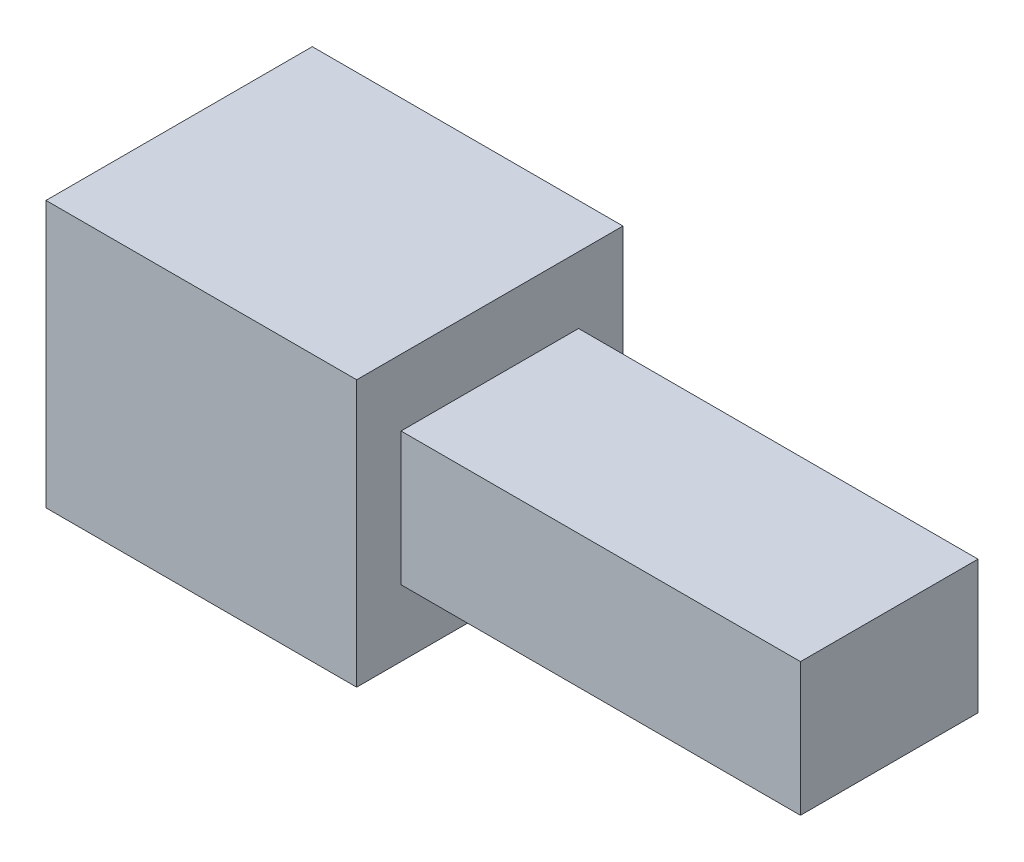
from build123d import *

# Parameters (mm, degrees)
SKETCH1_W                 = 4
SKETCH1_H                 = 3
BOSS_EXTRUDE1_DEPTH       = 10
BOSS_EXTRUDE18_DEPTH      = 1
BOSS_EXTRUDE18_DEPTH_BACK = 6
SKETCH4_W                 = 6
SKETCH4_H                 = 6


with BuildPart() as part:
    # Sketch1 → Boss-Extrude1 (new body)
    with BuildSketch(Plane(origin=(0, 0, 0), x_dir=(0, 0, -1), z_dir=(1, 0, 0))):
        Rectangle(SKETCH1_W, SKETCH1_H)
    extrude(amount=BOSS_EXTRUDE1_DEPTH)

    # Sketch4 → Boss-Extrude18 (add, two sides: drawn at the far end of the back side and taken through both)
    with BuildSketch(Plane(origin=(0, 0, 0), x_dir=(0, 0, -1), z_dir=(1, 0, 0)).offset(-BOSS_EXTRUDE18_DEPTH_BACK)):
        Rectangle(SKETCH4_W, SKETCH4_H)
        with BuildLine():
            Line((1.36689429, 1.46), (-1.36689429, 1.46))
            ThreePointArc((-1.36689429, 1.46), (0, -2), (1.36689429, 1.46))
        make_face(mode=Mode.SUBTRACT)
    extrude(amount=BOSS_EXTRUDE18_DEPTH + BOSS_EXTRUDE18_DEPTH_BACK)


solid = part.part
